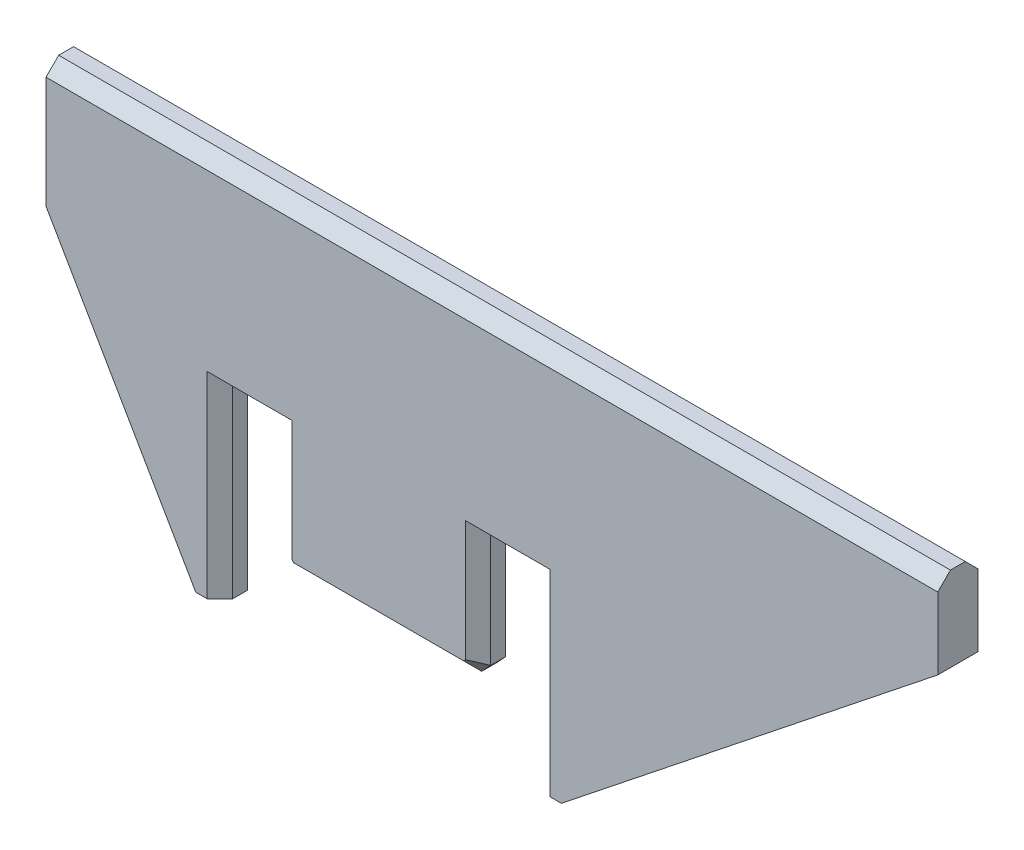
ISO-10303-21;
HEADER;
FILE_DESCRIPTION(('STEP AP214'),'2;1');
FILE_NAME('part.step','',(''),(''),'','','');
FILE_SCHEMA(('AUTOMOTIVE_DESIGN { 1 0 10303 214 1 1 1 1 }'));
ENDSEC;
DATA;
#1=APPLICATION_CONTEXT('core data for automotive mechanical design processes');
#2=APPLICATION_PROTOCOL_DEFINITION('international standard','automotive_design',2000,#1);
#3=PRODUCT_CONTEXT('',#1,'mechanical');
#4=PRODUCT('Part','Part','',(#3));
#5=PRODUCT_RELATED_PRODUCT_CATEGORY('part','',(#4));
#6=PRODUCT_DEFINITION_FORMATION('','',#4);
#7=PRODUCT_DEFINITION_CONTEXT('part definition',#1,'design');
#8=PRODUCT_DEFINITION('design','',#6,#7);
#9=PRODUCT_DEFINITION_SHAPE('','',#8);
#10=(LENGTH_UNIT() NAMED_UNIT(*) SI_UNIT(.MILLI.,.METRE.));
#11=(NAMED_UNIT(*) PLANE_ANGLE_UNIT() SI_UNIT($,.RADIAN.));
#12=(NAMED_UNIT(*) SI_UNIT($,.STERADIAN.) SOLID_ANGLE_UNIT());
#13=UNCERTAINTY_MEASURE_WITH_UNIT(LENGTH_MEASURE(1.E-05),#10,'distance_accuracy_value','');
#14=(GEOMETRIC_REPRESENTATION_CONTEXT(3) GLOBAL_UNCERTAINTY_ASSIGNED_CONTEXT((#13)) GLOBAL_UNIT_ASSIGNED_CONTEXT((#10,
#11,#12)) REPRESENTATION_CONTEXT('',''));
#15=CARTESIAN_POINT('',(0.,0.,0.));
#16=DIRECTION('',(0.,0.,1.));
#17=DIRECTION('',(1.,0.,0.));
#18=AXIS2_PLACEMENT_3D('',#15,#16,#17);
#19=CARTESIAN_POINT('',(882.496500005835,320.,31.75));
#20=DIRECTION('',(-1.,0.,0.));
#21=DIRECTION('',(0.,-1.,0.));
#22=AXIS2_PLACEMENT_3D('',#19,#20,#21);
#23=PLANE('',#22);
#24=DIRECTION('',(0.,1.,0.));
#25=VECTOR('',#24,1.);
#26=CARTESIAN_POINT('',(882.496500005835,320.,-31.75));
#27=LINE('',#26,#25);
#28=CARTESIAN_POINT('',(882.496500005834,186.669332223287,-31.75));
#29=VERTEX_POINT('',#28);
#30=CARTESIAN_POINT('',(882.496500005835,300.,-31.75));
#31=VERTEX_POINT('',#30);
#32=EDGE_CURVE('E279',#29,#31,#27,.T.);
#33=ORIENTED_EDGE('',*,*,#32,.T.);
#34=DIRECTION('',(0.,-0.707106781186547,-0.707106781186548));
#35=VECTOR('',#34,1.);
#36=CARTESIAN_POINT('',(882.496500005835,319.999999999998,-11.7500000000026));
#37=LINE('',#36,#35);
#38=CARTESIAN_POINT('',(882.496500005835,320.,-11.7500000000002));
#39=VERTEX_POINT('',#38);
#40=EDGE_CURVE('E489',#31,#39,#37,.F.);
#41=ORIENTED_EDGE('',*,*,#40,.T.);
#42=DIRECTION('',(0.,0.,-1.));
#43=VECTOR('',#42,1.);
#44=CARTESIAN_POINT('',(882.496500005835,320.,31.75));
#45=LINE('',#44,#43);
#46=CARTESIAN_POINT('',(882.496500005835,320.,11.7500000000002));
#47=VERTEX_POINT('',#46);
#48=EDGE_CURVE('E346',#47,#39,#45,.T.);
#49=ORIENTED_EDGE('',*,*,#48,.F.);
#50=DIRECTION('',(0.,-0.707106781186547,0.707106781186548));
#51=VECTOR('',#50,1.);
#52=CARTESIAN_POINT('',(882.496500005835,299.999999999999,31.7500000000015));
#53=LINE('',#52,#51);
#54=CARTESIAN_POINT('',(882.496500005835,300.,31.75));
#55=VERTEX_POINT('',#54);
#56=EDGE_CURVE('E387',#47,#55,#53,.T.);
#57=ORIENTED_EDGE('',*,*,#56,.T.);
#58=DIRECTION('',(0.,1.,0.));
#59=VECTOR('',#58,1.);
#60=CARTESIAN_POINT('',(882.496500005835,320.,31.75));
#61=LINE('',#60,#59);
#62=CARTESIAN_POINT('',(882.496500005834,186.669332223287,31.75));
#63=VERTEX_POINT('',#62);
#64=EDGE_CURVE('E250',#63,#55,#61,.T.);
#65=ORIENTED_EDGE('',*,*,#64,.F.);
#66=DIRECTION('',(0.,0.,-1.));
#67=VECTOR('',#66,1.);
#68=CARTESIAN_POINT('',(882.496500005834,186.669332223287,31.75));
#69=LINE('',#68,#67);
#70=EDGE_CURVE('E280',#63,#29,#69,.T.);
#71=ORIENTED_EDGE('',*,*,#70,.T.);
#72=EDGE_LOOP('',(#33,#41,#49,#57,#65,#71));
#73=FACE_BOUND('',#72,.T.);
#74=ADVANCED_FACE('F46',(#73),#23,.F.);
#75=CARTESIAN_POINT('',(-524.878159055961,320.,31.75));
#76=DIRECTION('',(0.,-1.,0.));
#77=DIRECTION('',(1.,0.,0.));
#78=AXIS2_PLACEMENT_3D('',#75,#76,#77);
#79=PLANE('',#78);
#80=ORIENTED_EDGE('',*,*,#48,.T.);
#81=DIRECTION('',(-1.,0.,0.));
#82=VECTOR('',#81,1.);
#83=CARTESIAN_POINT('',(-524.878159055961,320.,-11.7500000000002));
#84=LINE('',#83,#82);
#85=CARTESIAN_POINT('',(-524.878159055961,320.,-11.7500000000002));
#86=VERTEX_POINT('',#85);
#87=EDGE_CURVE('E422',#39,#86,#84,.T.);
#88=ORIENTED_EDGE('',*,*,#87,.T.);
#89=DIRECTION('',(0.,0.,-1.));
#90=VECTOR('',#89,1.);
#91=CARTESIAN_POINT('',(-524.878159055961,320.,31.75));
#92=LINE('',#91,#90);
#93=CARTESIAN_POINT('',(-524.878159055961,320.,11.7500000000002));
#94=VERTEX_POINT('',#93);
#95=EDGE_CURVE('E259',#94,#86,#92,.T.);
#96=ORIENTED_EDGE('',*,*,#95,.F.);
#97=DIRECTION('',(1.,0.,0.));
#98=VECTOR('',#97,1.);
#99=CARTESIAN_POINT('',(882.496500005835,320.,11.7500000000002));
#100=LINE('',#99,#98);
#101=EDGE_CURVE('E384',#94,#47,#100,.T.);
#102=ORIENTED_EDGE('',*,*,#101,.T.);
#103=EDGE_LOOP('',(#80,#88,#96,#102));
#104=FACE_BOUND('',#103,.T.);
#105=ADVANCED_FACE('F627',(#104),#79,.F.);
#106=CARTESIAN_POINT('',(-524.878159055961,320.,31.75));
#107=DIRECTION('',(1.,0.,0.));
#108=DIRECTION('',(0.,1.,0.));
#109=AXIS2_PLACEMENT_3D('',#106,#107,#108);
#110=PLANE('',#109);
#111=ORIENTED_EDGE('',*,*,#95,.T.);
#112=DIRECTION('',(0.,0.707106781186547,0.707106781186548));
#113=VECTOR('',#112,1.);
#114=CARTESIAN_POINT('',(-524.878159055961,320.,-11.7500000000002));
#115=LINE('',#114,#113);
#116=CARTESIAN_POINT('',(-524.878159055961,300.,-31.75));
#117=VERTEX_POINT('',#116);
#118=EDGE_CURVE('E460',#86,#117,#115,.F.);
#119=ORIENTED_EDGE('',*,*,#118,.T.);
#120=DIRECTION('',(0.,-1.,0.));
#121=VECTOR('',#120,1.);
#122=CARTESIAN_POINT('',(-524.878159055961,320.,-31.75));
#123=LINE('',#122,#121);
#124=CARTESIAN_POINT('',(-524.878159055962,123.605909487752,-31.75));
#125=VERTEX_POINT('',#124);
#126=EDGE_CURVE('E251',#117,#125,#123,.T.);
#127=ORIENTED_EDGE('',*,*,#126,.T.);
#128=DIRECTION('',(0.,0.,-1.));
#129=VECTOR('',#128,1.);
#130=CARTESIAN_POINT('',(-524.878159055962,123.605909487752,31.75));
#131=LINE('',#130,#129);
#132=CARTESIAN_POINT('',(-524.878159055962,123.605909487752,31.75));
#133=VERTEX_POINT('',#132);
#134=EDGE_CURVE('E249',#133,#125,#131,.T.);
#135=ORIENTED_EDGE('',*,*,#134,.F.);
#136=DIRECTION('',(0.,-1.,0.));
#137=VECTOR('',#136,1.);
#138=CARTESIAN_POINT('',(-524.878159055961,320.,31.75));
#139=LINE('',#138,#137);
#140=CARTESIAN_POINT('',(-524.878159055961,300.,31.75));
#141=VERTEX_POINT('',#140);
#142=EDGE_CURVE('E232',#141,#133,#139,.T.);
#143=ORIENTED_EDGE('',*,*,#142,.F.);
#144=DIRECTION('',(0.,0.707106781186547,-0.707106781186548));
#145=VECTOR('',#144,1.);
#146=CARTESIAN_POINT('',(-524.878159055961,300.000000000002,31.7499999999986));
#147=LINE('',#146,#145);
#148=EDGE_CURVE('E379',#141,#94,#147,.T.);
#149=ORIENTED_EDGE('',*,*,#148,.T.);
#150=EDGE_LOOP('',(#111,#119,#127,#135,#143,#149));
#151=FACE_BOUND('',#150,.T.);
#152=ADVANCED_FACE('F255',(#151),#110,.F.);
#153=CARTESIAN_POINT('',(-288.496,-285.82,31.75));
#154=DIRECTION('',(0.866025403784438,0.500000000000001,0.));
#155=DIRECTION('',(-0.500000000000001,0.866025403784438,0.));
#156=AXIS2_PLACEMENT_3D('',#153,#154,#155);
#157=PLANE('',#156);
#158=DIRECTION('',(0.500000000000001,-0.866025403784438,0.));
#159=VECTOR('',#158,1.);
#160=CARTESIAN_POINT('',(-288.496,-285.82,-31.75));
#161=LINE('',#160,#159);
#162=CARTESIAN_POINT('',(-288.496,-285.82,-31.75));
#163=VERTEX_POINT('',#162);
#164=EDGE_CURVE('E284',#125,#163,#161,.T.);
#165=ORIENTED_EDGE('',*,*,#164,.T.);
#166=DIRECTION('',(0.,0.,-1.));
#167=VECTOR('',#166,1.);
#168=CARTESIAN_POINT('',(-288.496,-285.82,31.75));
#169=LINE('',#168,#167);
#170=CARTESIAN_POINT('',(-288.496,-285.82,31.75));
#171=VERTEX_POINT('',#170);
#172=EDGE_CURVE('E256',#171,#163,#169,.T.);
#173=ORIENTED_EDGE('',*,*,#172,.F.);
#174=DIRECTION('',(0.500000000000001,-0.866025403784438,0.));
#175=VECTOR('',#174,1.);
#176=CARTESIAN_POINT('',(-288.496,-285.82,31.75));
#177=LINE('',#176,#175);
#178=EDGE_CURVE('E241',#133,#171,#177,.T.);
#179=ORIENTED_EDGE('',*,*,#178,.F.);
#180=ORIENTED_EDGE('',*,*,#134,.T.);
#181=EDGE_LOOP('',(#165,#173,#179,#180));
#182=FACE_BOUND('',#181,.T.);
#183=ADVANCED_FACE('F261',(#182),#157,.F.);
#184=CARTESIAN_POINT('',(-250.396,-285.82,31.75));
#185=DIRECTION('',(0.,1.,0.));
#186=DIRECTION('',(0.,0.,1.));
#187=AXIS2_PLACEMENT_3D('',#184,#185,#186);
#188=PLANE('',#187);
#189=DIRECTION('',(1.,0.,0.));
#190=VECTOR('',#189,1.);
#191=CARTESIAN_POINT('',(-250.396,-285.82,-31.75));
#192=LINE('',#191,#190);
#193=CARTESIAN_POINT('',(-270.396,-285.82,-31.75));
#194=VERTEX_POINT('',#193);
#195=EDGE_CURVE('E287',#163,#194,#192,.T.);
#196=ORIENTED_EDGE('',*,*,#195,.T.);
#197=DIRECTION('',(-0.707106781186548,0.,-0.707106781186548));
#198=VECTOR('',#197,1.);
#199=CARTESIAN_POINT('',(-250.396,-285.82,-11.75));
#200=LINE('',#199,#198);
#201=CARTESIAN_POINT('',(-250.396,-285.82,-11.75));
#202=VERTEX_POINT('',#201);
#203=EDGE_CURVE('E11',#194,#202,#200,.F.);
#204=ORIENTED_EDGE('',*,*,#203,.T.);
#205=DIRECTION('',(0.,0.,-1.));
#206=VECTOR('',#205,1.);
#207=CARTESIAN_POINT('',(-250.396,-285.82,31.75));
#208=LINE('',#207,#206);
#209=CARTESIAN_POINT('',(-250.396,-285.82,11.7499999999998));
#210=VERTEX_POINT('',#209);
#211=EDGE_CURVE('E339',#210,#202,#208,.T.);
#212=ORIENTED_EDGE('',*,*,#211,.F.);
#213=DIRECTION('',(-0.707106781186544,0.,0.707106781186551));
#214=VECTOR('',#213,1.);
#215=CARTESIAN_POINT('',(-270.396,-285.82,31.75));
#216=LINE('',#215,#214);
#217=CARTESIAN_POINT('',(-270.396,-285.82,31.75));
#218=VERTEX_POINT('',#217);
#219=EDGE_CURVE('E420',#210,#218,#216,.T.);
#220=ORIENTED_EDGE('',*,*,#219,.T.);
#221=DIRECTION('',(1.,0.,0.));
#222=VECTOR('',#221,1.);
#223=CARTESIAN_POINT('',(-250.396,-285.82,31.75));
#224=LINE('',#223,#222);
#225=EDGE_CURVE('E264',#171,#218,#224,.T.);
#226=ORIENTED_EDGE('',*,*,#225,.F.);
#227=ORIENTED_EDGE('',*,*,#172,.T.);
#228=EDGE_LOOP('',(#196,#204,#212,#220,#226,#227));
#229=FACE_BOUND('',#228,.T.);
#230=ADVANCED_FACE('F564',(#229),#188,.F.);
#231=CARTESIAN_POINT('',(-250.396,-285.82,31.75));
#232=DIRECTION('',(-1.,0.,0.));
#233=DIRECTION('',(0.,0.,1.));
#234=AXIS2_PLACEMENT_3D('',#231,#232,#233);
#235=PLANE('',#234);
#236=ORIENTED_EDGE('',*,*,#211,.T.);
#237=DIRECTION('',(0.,1.,0.));
#238=VECTOR('',#237,1.);
#239=CARTESIAN_POINT('',(-250.396,-285.82,-11.75));
#240=LINE('',#239,#238);
#241=CARTESIAN_POINT('',(-250.396,5.,-11.75));
#242=VERTEX_POINT('',#241);
#243=EDGE_CURVE('E60',#202,#242,#240,.T.);
#244=ORIENTED_EDGE('',*,*,#243,.T.);
#245=DIRECTION('',(0.,0.,-1.));
#246=VECTOR('',#245,1.);
#247=CARTESIAN_POINT('',(-250.396,5.,31.75));
#248=LINE('',#247,#246);
#249=CARTESIAN_POINT('',(-250.396,5.,11.7499999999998));
#250=VERTEX_POINT('',#249);
#251=EDGE_CURVE('E337',#250,#242,#248,.T.);
#252=ORIENTED_EDGE('',*,*,#251,.F.);
#253=DIRECTION('',(0.,-1.,0.));
#254=VECTOR('',#253,1.);
#255=CARTESIAN_POINT('',(-250.396,-285.82,11.7499999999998));
#256=LINE('',#255,#254);
#257=EDGE_CURVE('E418',#250,#210,#256,.T.);
#258=ORIENTED_EDGE('',*,*,#257,.T.);
#259=EDGE_LOOP('',(#236,#244,#252,#258));
#260=FACE_BOUND('',#259,.T.);
#261=ADVANCED_FACE('F853',(#260),#235,.F.);
#262=CARTESIAN_POINT('',(-250.396,5.,31.75));
#263=DIRECTION('',(0.,1.,0.));
#264=DIRECTION('',(0.,0.,1.));
#265=AXIS2_PLACEMENT_3D('',#262,#263,#264);
#266=PLANE('',#265);
#267=ORIENTED_EDGE('',*,*,#251,.T.);
#268=DIRECTION('',(1.,0.,0.));
#269=VECTOR('',#268,1.);
#270=CARTESIAN_POINT('',(-250.396,5.,-11.75));
#271=LINE('',#270,#269);
#272=CARTESIAN_POINT('',(-157.02,5.,-11.75));
#273=VERTEX_POINT('',#272);
#274=EDGE_CURVE('E519',#242,#273,#271,.T.);
#275=ORIENTED_EDGE('',*,*,#274,.T.);
#276=DIRECTION('',(0.,0.,-1.));
#277=VECTOR('',#276,1.);
#278=CARTESIAN_POINT('',(-157.02,5.,31.75));
#279=LINE('',#278,#277);
#280=CARTESIAN_POINT('',(-157.02,5.,11.7499999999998));
#281=VERTEX_POINT('',#280);
#282=EDGE_CURVE('E334',#281,#273,#279,.T.);
#283=ORIENTED_EDGE('',*,*,#282,.F.);
#284=DIRECTION('',(-1.,0.,0.));
#285=VECTOR('',#284,1.);
#286=CARTESIAN_POINT('',(-250.396,5.,11.7499999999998));
#287=LINE('',#286,#285);
#288=EDGE_CURVE('E412',#281,#250,#287,.T.);
#289=ORIENTED_EDGE('',*,*,#288,.T.);
#290=EDGE_LOOP('',(#267,#275,#283,#289));
#291=FACE_BOUND('',#290,.T.);
#292=ADVANCED_FACE('F845',(#291),#266,.F.);
#293=CARTESIAN_POINT('',(-157.02,-172.974,31.75));
#294=DIRECTION('',(1.,0.,0.));
#295=DIRECTION('',(0.,0.,-1.));
#296=AXIS2_PLACEMENT_3D('',#293,#294,#295);
#297=PLANE('',#296);
#298=ORIENTED_EDGE('',*,*,#282,.T.);
#299=DIRECTION('',(0.,-1.,0.));
#300=VECTOR('',#299,1.);
#301=CARTESIAN_POINT('',(-157.02,-172.974,-11.75));
#302=LINE('',#301,#300);
#303=CARTESIAN_POINT('',(-157.02,-172.974,-11.75));
#304=VERTEX_POINT('',#303);
#305=EDGE_CURVE('E513',#273,#304,#302,.T.);
#306=ORIENTED_EDGE('',*,*,#305,.T.);
#307=DIRECTION('',(0.,0.,-1.));
#308=VECTOR('',#307,1.);
#309=CARTESIAN_POINT('',(-157.02,-172.974,31.75));
#310=LINE('',#309,#308);
#311=CARTESIAN_POINT('',(-157.02,-172.974,11.7499999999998));
#312=VERTEX_POINT('',#311);
#313=EDGE_CURVE('E327',#312,#304,#310,.T.);
#314=ORIENTED_EDGE('',*,*,#313,.F.);
#315=DIRECTION('',(0.,1.,0.));
#316=VECTOR('',#315,1.);
#317=CARTESIAN_POINT('',(-157.02,5.,11.7499999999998));
#318=LINE('',#317,#316);
#319=EDGE_CURVE('E408',#312,#281,#318,.T.);
#320=ORIENTED_EDGE('',*,*,#319,.T.);
#321=EDGE_LOOP('',(#298,#306,#314,#320));
#322=FACE_BOUND('',#321,.T.);
#323=ADVANCED_FACE('F832',(#322),#297,.F.);
#324=CARTESIAN_POINT('',(-142.78,-188.214,31.75));
#325=DIRECTION('',(0.730672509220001,0.682728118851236,0.));
#326=DIRECTION('',(-0.682728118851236,0.730672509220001,0.));
#327=AXIS2_PLACEMENT_3D('',#324,#325,#326);
#328=PLANE('',#327);
#329=ORIENTED_EDGE('',*,*,#313,.T.);
#330=DIRECTION('',(0.682728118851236,-0.730672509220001,0.));
#331=VECTOR('',#330,1.);
#332=CARTESIAN_POINT('',(-142.78,-188.214,-11.75));
#333=LINE('',#332,#331);
#334=CARTESIAN_POINT('',(-142.78,-188.214,-11.75));
#335=VERTEX_POINT('',#334);
#336=EDGE_CURVE('E515',#304,#335,#333,.T.);
#337=ORIENTED_EDGE('',*,*,#336,.T.);
#338=DIRECTION('',(0.,0.,-1.));
#339=VECTOR('',#338,1.);
#340=CARTESIAN_POINT('',(-142.78,-188.214,31.75));
#341=LINE('',#340,#339);
#342=CARTESIAN_POINT('',(-142.78,-188.214,11.7499999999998));
#343=VERTEX_POINT('',#342);
#344=EDGE_CURVE('E321',#343,#335,#341,.T.);
#345=ORIENTED_EDGE('',*,*,#344,.F.);
#346=DIRECTION('',(-0.682728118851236,0.730672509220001,0.));
#347=VECTOR('',#346,1.);
#348=CARTESIAN_POINT('',(-157.02,-172.974,11.7499999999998));
#349=LINE('',#348,#347);
#350=EDGE_CURVE('E410',#343,#312,#349,.T.);
#351=ORIENTED_EDGE('',*,*,#350,.T.);
#352=EDGE_LOOP('',(#329,#337,#345,#351));
#353=FACE_BOUND('',#352,.T.);
#354=ADVANCED_FACE('F822',(#353),#328,.F.);
#355=CARTESIAN_POINT('',(142.78,-188.214,31.75));
#356=DIRECTION('',(0.,1.,0.));
#357=DIRECTION('',(0.,0.,1.));
#358=AXIS2_PLACEMENT_3D('',#355,#356,#357);
#359=PLANE('',#358);
#360=ORIENTED_EDGE('',*,*,#344,.T.);
#361=DIRECTION('',(1.,0.,0.));
#362=VECTOR('',#361,1.);
#363=CARTESIAN_POINT('',(142.78,-188.214,-11.75));
#364=LINE('',#363,#362);
#365=CARTESIAN_POINT('',(142.78,-188.214,-11.75));
#366=VERTEX_POINT('',#365);
#367=EDGE_CURVE('E508',#335,#366,#364,.T.);
#368=ORIENTED_EDGE('',*,*,#367,.T.);
#369=DIRECTION('',(0.,0.,-1.));
#370=VECTOR('',#369,1.);
#371=CARTESIAN_POINT('',(142.78,-188.214,31.75));
#372=LINE('',#371,#370);
#373=CARTESIAN_POINT('',(142.78,-188.214,11.7499999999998));
#374=VERTEX_POINT('',#373);
#375=EDGE_CURVE('E318',#374,#366,#372,.T.);
#376=ORIENTED_EDGE('',*,*,#375,.F.);
#377=DIRECTION('',(-1.,0.,0.));
#378=VECTOR('',#377,1.);
#379=CARTESIAN_POINT('',(-142.78,-188.214,11.7499999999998));
#380=LINE('',#379,#378);
#381=EDGE_CURVE('E404',#374,#343,#380,.T.);
#382=ORIENTED_EDGE('',*,*,#381,.T.);
#383=EDGE_LOOP('',(#360,#368,#376,#382));
#384=FACE_BOUND('',#383,.T.);
#385=ADVANCED_FACE('F814',(#384),#359,.F.);
#386=CARTESIAN_POINT('',(142.78,-188.214,31.75));
#387=DIRECTION('',(-0.730672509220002,0.682728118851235,0.));
#388=DIRECTION('',(-0.682728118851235,-0.730672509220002,0.));
#389=AXIS2_PLACEMENT_3D('',#386,#387,#388);
#390=PLANE('',#389);
#391=ORIENTED_EDGE('',*,*,#375,.T.);
#392=DIRECTION('',(0.682728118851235,0.730672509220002,0.));
#393=VECTOR('',#392,1.);
#394=CARTESIAN_POINT('',(142.78,-188.214,-11.75));
#395=LINE('',#394,#393);
#396=CARTESIAN_POINT('',(157.02,-172.974,-11.75));
#397=VERTEX_POINT('',#396);
#398=EDGE_CURVE('E506',#366,#397,#395,.T.);
#399=ORIENTED_EDGE('',*,*,#398,.T.);
#400=DIRECTION('',(0.,0.,-1.));
#401=VECTOR('',#400,1.);
#402=CARTESIAN_POINT('',(157.02,-172.974,31.75));
#403=LINE('',#402,#401);
#404=CARTESIAN_POINT('',(157.02,-172.974,11.7499999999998));
#405=VERTEX_POINT('',#404);
#406=EDGE_CURVE('E317',#405,#397,#403,.T.);
#407=ORIENTED_EDGE('',*,*,#406,.F.);
#408=DIRECTION('',(-0.682728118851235,-0.730672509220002,0.));
#409=VECTOR('',#408,1.);
#410=CARTESIAN_POINT('',(142.78,-188.214,11.7499999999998));
#411=LINE('',#410,#409);
#412=EDGE_CURVE('E402',#405,#374,#411,.T.);
#413=ORIENTED_EDGE('',*,*,#412,.T.);
#414=EDGE_LOOP('',(#391,#399,#407,#413));
#415=FACE_BOUND('',#414,.T.);
#416=ADVANCED_FACE('F808',(#415),#390,.F.);
#417=CARTESIAN_POINT('',(157.02,5.00000000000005,31.75));
#418=DIRECTION('',(-1.,0.,0.));
#419=DIRECTION('',(0.,-1.,0.));
#420=AXIS2_PLACEMENT_3D('',#417,#418,#419);
#421=PLANE('',#420);
#422=ORIENTED_EDGE('',*,*,#406,.T.);
#423=DIRECTION('',(0.,1.,0.));
#424=VECTOR('',#423,1.);
#425=CARTESIAN_POINT('',(157.02,5.00000000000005,-11.75));
#426=LINE('',#425,#424);
#427=CARTESIAN_POINT('',(157.02,5.00000000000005,-11.75));
#428=VERTEX_POINT('',#427);
#429=EDGE_CURVE('E503',#397,#428,#426,.T.);
#430=ORIENTED_EDGE('',*,*,#429,.T.);
#431=DIRECTION('',(0.,0.,-1.));
#432=VECTOR('',#431,1.);
#433=CARTESIAN_POINT('',(157.02,5.00000000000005,31.75));
#434=LINE('',#433,#432);
#435=CARTESIAN_POINT('',(157.02,5.00000000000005,11.7499999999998));
#436=VERTEX_POINT('',#435);
#437=EDGE_CURVE('E315',#436,#428,#434,.T.);
#438=ORIENTED_EDGE('',*,*,#437,.F.);
#439=DIRECTION('',(0.,-1.,0.));
#440=VECTOR('',#439,1.);
#441=CARTESIAN_POINT('',(157.02,-172.974,11.7499999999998));
#442=LINE('',#441,#440);
#443=EDGE_CURVE('E397',#436,#405,#442,.T.);
#444=ORIENTED_EDGE('',*,*,#443,.T.);
#445=EDGE_LOOP('',(#422,#430,#438,#444));
#446=FACE_BOUND('',#445,.T.);
#447=ADVANCED_FACE('F800',(#446),#421,.F.);
#448=CARTESIAN_POINT('',(157.02,5.00000000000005,31.75));
#449=DIRECTION('',(0.,1.,0.));
#450=DIRECTION('',(-1.,0.,0.));
#451=AXIS2_PLACEMENT_3D('',#448,#449,#450);
#452=PLANE('',#451);
#453=ORIENTED_EDGE('',*,*,#437,.T.);
#454=DIRECTION('',(1.,0.,0.));
#455=VECTOR('',#454,1.);
#456=CARTESIAN_POINT('',(157.02,5.00000000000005,-11.75));
#457=LINE('',#456,#455);
#458=CARTESIAN_POINT('',(250.396,5.00000000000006,-11.75));
#459=VERTEX_POINT('',#458);
#460=EDGE_CURVE('E499',#428,#459,#457,.T.);
#461=ORIENTED_EDGE('',*,*,#460,.T.);
#462=DIRECTION('',(0.,0.,-1.));
#463=VECTOR('',#462,1.);
#464=CARTESIAN_POINT('',(250.396,5.00000000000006,31.75));
#465=LINE('',#464,#463);
#466=CARTESIAN_POINT('',(250.396,5.00000000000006,11.7499999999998));
#467=VERTEX_POINT('',#466);
#468=EDGE_CURVE('E308',#467,#459,#465,.T.);
#469=ORIENTED_EDGE('',*,*,#468,.F.);
#470=DIRECTION('',(-1.,0.,0.));
#471=VECTOR('',#470,1.);
#472=CARTESIAN_POINT('',(157.02,5.00000000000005,11.7499999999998));
#473=LINE('',#472,#471);
#474=EDGE_CURVE('E394',#467,#436,#473,.T.);
#475=ORIENTED_EDGE('',*,*,#474,.T.);
#476=EDGE_LOOP('',(#453,#461,#469,#475));
#477=FACE_BOUND('',#476,.T.);
#478=ADVANCED_FACE('F787',(#477),#452,.F.);
#479=CARTESIAN_POINT('',(250.396,-285.82,31.75));
#480=DIRECTION('',(1.,0.,0.));
#481=DIRECTION('',(0.,0.,-1.));
#482=AXIS2_PLACEMENT_3D('',#479,#480,#481);
#483=PLANE('',#482);
#484=ORIENTED_EDGE('',*,*,#468,.T.);
#485=DIRECTION('',(0.,-1.,0.));
#486=VECTOR('',#485,1.);
#487=CARTESIAN_POINT('',(250.396,-285.82,-11.75));
#488=LINE('',#487,#486);
#489=CARTESIAN_POINT('',(250.396,-285.82,-11.75));
#490=VERTEX_POINT('',#489);
#491=EDGE_CURVE('E491',#459,#490,#488,.T.);
#492=ORIENTED_EDGE('',*,*,#491,.T.);
#493=DIRECTION('',(0.,0.,-1.));
#494=VECTOR('',#493,1.);
#495=CARTESIAN_POINT('',(250.396,-285.82,31.75));
#496=LINE('',#495,#494);
#497=CARTESIAN_POINT('',(250.396,-285.82,11.7499999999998));
#498=VERTEX_POINT('',#497);
#499=EDGE_CURVE('E302',#498,#490,#496,.T.);
#500=ORIENTED_EDGE('',*,*,#499,.F.);
#501=DIRECTION('',(0.,1.,0.));
#502=VECTOR('',#501,1.);
#503=CARTESIAN_POINT('',(250.396,5.00000000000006,11.7499999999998));
#504=LINE('',#503,#502);
#505=EDGE_CURVE('E395',#498,#467,#504,.T.);
#506=ORIENTED_EDGE('',*,*,#505,.T.);
#507=EDGE_LOOP('',(#484,#492,#500,#506));
#508=FACE_BOUND('',#507,.T.);
#509=ADVANCED_FACE('F776',(#508),#483,.F.);
#510=CARTESIAN_POINT('',(250.396,-285.82,31.75));
#511=DIRECTION('',(0.,1.,0.));
#512=DIRECTION('',(-1.,0.,0.));
#513=AXIS2_PLACEMENT_3D('',#510,#511,#512);
#514=PLANE('',#513);
#515=ORIENTED_EDGE('',*,*,#499,.T.);
#516=DIRECTION('',(-0.707106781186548,0.,0.707106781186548));
#517=VECTOR('',#516,1.);
#518=CARTESIAN_POINT('',(250.396,-285.82,-11.75));
#519=LINE('',#518,#517);
#520=CARTESIAN_POINT('',(270.396,-285.82,-31.75));
#521=VERTEX_POINT('',#520);
#522=EDGE_CURVE('E500',#490,#521,#519,.F.);
#523=ORIENTED_EDGE('',*,*,#522,.T.);
#524=DIRECTION('',(1.,0.,0.));
#525=VECTOR('',#524,1.);
#526=CARTESIAN_POINT('',(250.396,-285.82,-31.75));
#527=LINE('',#526,#525);
#528=CARTESIAN_POINT('',(288.496,-285.82,-31.75));
#529=VERTEX_POINT('',#528);
#530=EDGE_CURVE('E293',#521,#529,#527,.T.);
#531=ORIENTED_EDGE('',*,*,#530,.T.);
#532=DIRECTION('',(0.,0.,-1.));
#533=VECTOR('',#532,1.);
#534=CARTESIAN_POINT('',(288.496,-285.82,31.75));
#535=LINE('',#534,#533);
#536=CARTESIAN_POINT('',(288.496,-285.82,31.75));
#537=VERTEX_POINT('',#536);
#538=EDGE_CURVE('E297',#537,#529,#535,.T.);
#539=ORIENTED_EDGE('',*,*,#538,.F.);
#540=DIRECTION('',(1.,0.,0.));
#541=VECTOR('',#540,1.);
#542=CARTESIAN_POINT('',(250.396,-285.82,31.75));
#543=LINE('',#542,#541);
#544=CARTESIAN_POINT('',(270.396,-285.82,31.75));
#545=VERTEX_POINT('',#544);
#546=EDGE_CURVE('E267',#545,#537,#543,.T.);
#547=ORIENTED_EDGE('',*,*,#546,.F.);
#548=DIRECTION('',(-0.707106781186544,0.,-0.707106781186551));
#549=VECTOR('',#548,1.);
#550=CARTESIAN_POINT('',(270.396,-285.82,31.7500000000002));
#551=LINE('',#550,#549);
#552=EDGE_CURVE('E386',#545,#498,#551,.T.);
#553=ORIENTED_EDGE('',*,*,#552,.T.);
#554=EDGE_LOOP('',(#515,#523,#531,#539,#547,#553));
#555=FACE_BOUND('',#554,.T.);
#556=ADVANCED_FACE('F614',(#555),#514,.F.);
#557=CARTESIAN_POINT('',(288.496,-285.82,31.75));
#558=DIRECTION('',(-0.622514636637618,0.782608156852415,0.));
#559=DIRECTION('',(-0.782608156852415,-0.622514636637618,0.));
#560=AXIS2_PLACEMENT_3D('',#557,#558,#559);
#561=PLANE('',#560);
#562=DIRECTION('',(0.782608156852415,0.622514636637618,0.));
#563=VECTOR('',#562,1.);
#564=CARTESIAN_POINT('',(288.496,-285.82,-31.75));
#565=LINE('',#564,#563);
#566=EDGE_CURVE('E295',#529,#29,#565,.T.);
#567=ORIENTED_EDGE('',*,*,#566,.T.);
#568=ORIENTED_EDGE('',*,*,#70,.F.);
#569=DIRECTION('',(0.782608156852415,0.622514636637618,0.));
#570=VECTOR('',#569,1.);
#571=CARTESIAN_POINT('',(288.496,-285.82,31.75));
#572=LINE('',#571,#570);
#573=EDGE_CURVE('E274',#537,#63,#572,.T.);
#574=ORIENTED_EDGE('',*,*,#573,.F.);
#575=ORIENTED_EDGE('',*,*,#538,.T.);
#576=EDGE_LOOP('',(#567,#568,#574,#575));
#577=FACE_BOUND('',#576,.T.);
#578=ADVANCED_FACE('F620',(#577),#561,.F.);
#579=CARTESIAN_POINT('',(0.,0.,31.75));
#580=DIRECTION('',(0.,0.,1.));
#581=DIRECTION('',(1.,0.,0.));
#582=AXIS2_PLACEMENT_3D('',#579,#580,#581);
#583=PLANE('',#582);
#584=ORIENTED_EDGE('',*,*,#64,.T.);
#585=DIRECTION('',(-1.,0.,0.));
#586=VECTOR('',#585,1.);
#587=CARTESIAN_POINT('',(-524.878159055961,300.,31.75));
#588=LINE('',#587,#586);
#589=EDGE_CURVE('E242',#55,#141,#588,.T.);
#590=ORIENTED_EDGE('',*,*,#589,.T.);
#591=ORIENTED_EDGE('',*,*,#142,.T.);
#592=ORIENTED_EDGE('',*,*,#178,.T.);
#593=ORIENTED_EDGE('',*,*,#225,.T.);
#594=DIRECTION('',(0.,1.,0.));
#595=VECTOR('',#594,1.);
#596=CARTESIAN_POINT('',(-270.396,5.,31.75));
#597=LINE('',#596,#595);
#598=CARTESIAN_POINT('',(-270.396,25.,31.75));
#599=VERTEX_POINT('',#598);
#600=EDGE_CURVE('E349',#218,#599,#597,.T.);
#601=ORIENTED_EDGE('',*,*,#600,.T.);
#602=DIRECTION('',(1.,0.,0.));
#603=VECTOR('',#602,1.);
#604=CARTESIAN_POINT('',(-157.02,25.,31.75));
#605=LINE('',#604,#603);
#606=CARTESIAN_POINT('',(-137.02,25.,31.75));
#607=VERTEX_POINT('',#606);
#608=EDGE_CURVE('E352',#599,#607,#605,.T.);
#609=ORIENTED_EDGE('',*,*,#608,.T.);
#610=DIRECTION('',(0.,-1.,0.));
#611=VECTOR('',#610,1.);
#612=CARTESIAN_POINT('',(-137.02,-172.974,31.75));
#613=LINE('',#612,#611);
#614=CARTESIAN_POINT('',(-137.02,-165.0842563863,31.75));
#615=VERTEX_POINT('',#614);
#616=EDGE_CURVE('E358',#607,#615,#613,.T.);
#617=ORIENTED_EDGE('',*,*,#616,.T.);
#618=DIRECTION('',(0.682728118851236,-0.730672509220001,0.));
#619=VECTOR('',#618,1.);
#620=CARTESIAN_POINT('',(-128.1665498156,-174.559437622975,31.75));
#621=LINE('',#620,#619);
#622=CARTESIAN_POINT('',(-134.09562014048,-168.214,31.75));
#623=VERTEX_POINT('',#622);
#624=EDGE_CURVE('E360',#615,#623,#621,.T.);
#625=ORIENTED_EDGE('',*,*,#624,.T.);
#626=DIRECTION('',(1.,0.,0.));
#627=VECTOR('',#626,1.);
#628=CARTESIAN_POINT('',(142.78,-168.214,31.75));
#629=LINE('',#628,#627);
#630=CARTESIAN_POINT('',(134.09562014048,-168.214,31.75));
#631=VERTEX_POINT('',#630);
#632=EDGE_CURVE('E365',#623,#631,#629,.T.);
#633=ORIENTED_EDGE('',*,*,#632,.T.);
#634=DIRECTION('',(0.682728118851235,0.730672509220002,0.));
#635=VECTOR('',#634,1.);
#636=CARTESIAN_POINT('',(142.4065498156,-159.319437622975,31.75));
#637=LINE('',#636,#635);
#638=CARTESIAN_POINT('',(137.02,-165.0842563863,31.75));
#639=VERTEX_POINT('',#638);
#640=EDGE_CURVE('E362',#631,#639,#637,.T.);
#641=ORIENTED_EDGE('',*,*,#640,.T.);
#642=DIRECTION('',(0.,1.,0.));
#643=VECTOR('',#642,1.);
#644=CARTESIAN_POINT('',(137.02,5.00000000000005,31.75));
#645=LINE('',#644,#643);
#646=CARTESIAN_POINT('',(137.02,25.0000000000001,31.75));
#647=VERTEX_POINT('',#646);
#648=EDGE_CURVE('E368',#639,#647,#645,.T.);
#649=ORIENTED_EDGE('',*,*,#648,.T.);
#650=DIRECTION('',(1.,0.,0.));
#651=VECTOR('',#650,1.);
#652=CARTESIAN_POINT('',(250.396,25.0000000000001,31.75));
#653=LINE('',#652,#651);
#654=CARTESIAN_POINT('',(270.396,25.0000000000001,31.75));
#655=VERTEX_POINT('',#654);
#656=EDGE_CURVE('E371',#647,#655,#653,.T.);
#657=ORIENTED_EDGE('',*,*,#656,.T.);
#658=DIRECTION('',(0.,-1.,0.));
#659=VECTOR('',#658,1.);
#660=CARTESIAN_POINT('',(270.396,-285.82,31.75));
#661=LINE('',#660,#659);
#662=EDGE_CURVE('E372',#655,#545,#661,.T.);
#663=ORIENTED_EDGE('',*,*,#662,.T.);
#664=ORIENTED_EDGE('',*,*,#546,.T.);
#665=ORIENTED_EDGE('',*,*,#573,.T.);
#666=EDGE_LOOP('',(#584,#590,#591,#592,#593,#601,#609,#617,#625,#633,#641,#649,#657,#663,#664,#665));
#667=FACE_BOUND('',#666,.T.);
#668=ADVANCED_FACE('F238',(#667),#583,.T.);
#669=CARTESIAN_POINT('',(0.,0.,-31.75));
#670=DIRECTION('',(0.,0.,1.));
#671=DIRECTION('',(1.,0.,0.));
#672=AXIS2_PLACEMENT_3D('',#669,#670,#671);
#673=PLANE('',#672);
#674=ORIENTED_EDGE('',*,*,#126,.F.);
#675=DIRECTION('',(1.,0.,0.));
#676=VECTOR('',#675,1.);
#677=CARTESIAN_POINT('',(0.,300.,-31.75));
#678=LINE('',#677,#676);
#679=EDGE_CURVE('E487',#117,#31,#678,.T.);
#680=ORIENTED_EDGE('',*,*,#679,.T.);
#681=ORIENTED_EDGE('',*,*,#32,.F.);
#682=ORIENTED_EDGE('',*,*,#566,.F.);
#683=ORIENTED_EDGE('',*,*,#530,.F.);
#684=DIRECTION('',(0.,1.,0.));
#685=VECTOR('',#684,1.);
#686=CARTESIAN_POINT('',(270.396,0.,-31.75));
#687=LINE('',#686,#685);
#688=CARTESIAN_POINT('',(270.396,25.0000000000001,-31.75));
#689=VERTEX_POINT('',#688);
#690=EDGE_CURVE('E485',#521,#689,#687,.T.);
#691=ORIENTED_EDGE('',*,*,#690,.T.);
#692=DIRECTION('',(-1.,0.,0.));
#693=VECTOR('',#692,1.);
#694=CARTESIAN_POINT('',(0.,25.0000000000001,-31.75));
#695=LINE('',#694,#693);
#696=CARTESIAN_POINT('',(137.02,25.0000000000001,-31.75));
#697=VERTEX_POINT('',#696);
#698=EDGE_CURVE('E483',#689,#697,#695,.T.);
#699=ORIENTED_EDGE('',*,*,#698,.T.);
#700=DIRECTION('',(0.,-1.,0.));
#701=VECTOR('',#700,1.);
#702=CARTESIAN_POINT('',(137.02,0.,-31.75));
#703=LINE('',#702,#701);
#704=CARTESIAN_POINT('',(137.02,-165.0842563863,-31.75));
#705=VERTEX_POINT('',#704);
#706=EDGE_CURVE('E477',#697,#705,#703,.T.);
#707=ORIENTED_EDGE('',*,*,#706,.T.);
#708=DIRECTION('',(-0.682728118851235,-0.730672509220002,0.));
#709=VECTOR('',#708,1.);
#710=CARTESIAN_POINT('',(155.504946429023,-145.301209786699,-31.75));
#711=LINE('',#710,#709);
#712=CARTESIAN_POINT('',(134.09562014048,-168.214,-31.75));
#713=VERTEX_POINT('',#712);
#714=EDGE_CURVE('E473',#705,#713,#711,.T.);
#715=ORIENTED_EDGE('',*,*,#714,.T.);
#716=DIRECTION('',(-1.,0.,0.));
#717=VECTOR('',#716,1.);
#718=CARTESIAN_POINT('',(0.,-168.214,-31.75));
#719=LINE('',#718,#717);
#720=CARTESIAN_POINT('',(-134.09562014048,-168.214,-31.75));
#721=VERTEX_POINT('',#720);
#722=EDGE_CURVE('E475',#713,#721,#719,.T.);
#723=ORIENTED_EDGE('',*,*,#722,.T.);
#724=DIRECTION('',(-0.682728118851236,0.730672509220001,0.));
#725=VECTOR('',#724,1.);
#726=CARTESIAN_POINT('',(-155.504946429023,-145.301209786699,-31.75));
#727=LINE('',#726,#725);
#728=CARTESIAN_POINT('',(-137.02,-165.0842563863,-31.75));
#729=VERTEX_POINT('',#728);
#730=EDGE_CURVE('E469',#721,#729,#727,.T.);
#731=ORIENTED_EDGE('',*,*,#730,.T.);
#732=DIRECTION('',(0.,1.,0.));
#733=VECTOR('',#732,1.);
#734=CARTESIAN_POINT('',(-137.02,0.,-31.75));
#735=LINE('',#734,#733);
#736=CARTESIAN_POINT('',(-137.02,25.,-31.75));
#737=VERTEX_POINT('',#736);
#738=EDGE_CURVE('E467',#729,#737,#735,.T.);
#739=ORIENTED_EDGE('',*,*,#738,.T.);
#740=DIRECTION('',(-1.,0.,0.));
#741=VECTOR('',#740,1.);
#742=CARTESIAN_POINT('',(0.,25.,-31.75));
#743=LINE('',#742,#741);
#744=CARTESIAN_POINT('',(-270.396,25.,-31.75));
#745=VERTEX_POINT('',#744);
#746=EDGE_CURVE('E462',#737,#745,#743,.T.);
#747=ORIENTED_EDGE('',*,*,#746,.T.);
#748=DIRECTION('',(0.,-1.,0.));
#749=VECTOR('',#748,1.);
#750=CARTESIAN_POINT('',(-270.396,0.,-31.75));
#751=LINE('',#750,#749);
#752=EDGE_CURVE('E459',#745,#194,#751,.T.);
#753=ORIENTED_EDGE('',*,*,#752,.T.);
#754=ORIENTED_EDGE('',*,*,#195,.F.);
#755=ORIENTED_EDGE('',*,*,#164,.F.);
#756=EDGE_LOOP('',(#674,#680,#681,#682,#683,#691,#699,#707,#715,#723,#731,#739,#747,#753,#754,#755));
#757=FACE_BOUND('',#756,.T.);
#758=ADVANCED_FACE('F562',(#757),#673,.F.);
#759=CARTESIAN_POINT('',(0.,300.,31.75));
#760=DIRECTION('',(0.,0.707106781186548,0.707106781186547));
#761=DIRECTION('',(1.,0.,0.));
#762=AXIS2_PLACEMENT_3D('',#759,#760,#761);
#763=PLANE('',#762);
#764=ORIENTED_EDGE('',*,*,#56,.F.);
#765=ORIENTED_EDGE('',*,*,#101,.F.);
#766=ORIENTED_EDGE('',*,*,#148,.F.);
#767=ORIENTED_EDGE('',*,*,#589,.F.);
#768=EDGE_LOOP('',(#764,#765,#766,#767));
#769=FACE_BOUND('',#768,.T.);
#770=ADVANCED_FACE('F622',(#769),#763,.T.);
#771=CARTESIAN_POINT('',(-270.396,0.,31.75));
#772=DIRECTION('',(0.707106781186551,0.,0.707106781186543));
#773=DIRECTION('',(0.,-1.,0.));
#774=AXIS2_PLACEMENT_3D('',#771,#772,#773);
#775=PLANE('',#774);
#776=ORIENTED_EDGE('',*,*,#219,.F.);
#777=ORIENTED_EDGE('',*,*,#257,.F.);
#778=DIRECTION('',(-0.577350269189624,0.577350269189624,0.57735026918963));
#779=VECTOR('',#778,1.);
#780=CARTESIAN_POINT('',(-180.264000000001,-65.1319999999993,-58.3820000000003));
#781=LINE('',#780,#779);
#782=EDGE_CURVE('E285',#599,#250,#781,.F.);
#783=ORIENTED_EDGE('',*,*,#782,.F.);
#784=ORIENTED_EDGE('',*,*,#600,.F.);
#785=EDGE_LOOP('',(#776,#777,#783,#784));
#786=FACE_BOUND('',#785,.T.);
#787=ADVANCED_FACE('F569',(#786),#775,.T.);
#788=CARTESIAN_POINT('',(0.,25.,31.75));
#789=DIRECTION('',(0.,-0.707106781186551,0.707106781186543));
#790=DIRECTION('',(-1.,0.,0.));
#791=AXIS2_PLACEMENT_3D('',#788,#789,#790);
#792=PLANE('',#791);
#793=ORIENTED_EDGE('',*,*,#782,.T.);
#794=ORIENTED_EDGE('',*,*,#288,.F.);
#795=DIRECTION('',(0.577350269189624,0.577350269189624,0.57735026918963));
#796=VECTOR('',#795,1.);
#797=CARTESIAN_POINT('',(-145.353333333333,16.6666666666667,23.4166666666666));
#798=LINE('',#797,#796);
#799=EDGE_CURVE('E450',#607,#281,#798,.F.);
#800=ORIENTED_EDGE('',*,*,#799,.F.);
#801=ORIENTED_EDGE('',*,*,#608,.F.);
#802=EDGE_LOOP('',(#793,#794,#800,#801));
#803=FACE_BOUND('',#802,.T.);
#804=ADVANCED_FACE('F577',(#803),#792,.T.);
#805=CARTESIAN_POINT('',(-137.02,0.,31.75));
#806=DIRECTION('',(-0.707106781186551,0.,0.707106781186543));
#807=DIRECTION('',(0.,1.,0.));
#808=AXIS2_PLACEMENT_3D('',#805,#806,#807);
#809=PLANE('',#808);
#810=ORIENTED_EDGE('',*,*,#799,.T.);
#811=ORIENTED_EDGE('',*,*,#319,.F.);
#812=DIRECTION('',(0.681104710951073,0.268687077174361,0.68110471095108));
#813=VECTOR('',#812,1.);
#814=CARTESIAN_POINT('',(-106.808915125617,-153.166370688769,61.9610848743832));
#815=LINE('',#814,#813);
#816=EDGE_CURVE('E442',#615,#312,#815,.F.);
#817=ORIENTED_EDGE('',*,*,#816,.F.);
#818=ORIENTED_EDGE('',*,*,#616,.F.);
#819=EDGE_LOOP('',(#810,#811,#817,#818));
#820=FACE_BOUND('',#819,.T.);
#821=ADVANCED_FACE('F584',(#820),#809,.T.);
#822=CARTESIAN_POINT('',(-155.504946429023,-145.301209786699,31.75));
#823=DIRECTION('',(-0.516663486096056,-0.482761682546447,0.707106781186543));
#824=DIRECTION('',(-0.682728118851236,0.730672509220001,0.));
#825=AXIS2_PLACEMENT_3D('',#822,#823,#824);
#826=PLANE('',#825);
#827=ORIENTED_EDGE('',*,*,#816,.T.);
#828=ORIENTED_EDGE('',*,*,#350,.F.);
#829=DIRECTION('',(0.293515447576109,0.67596178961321,0.675961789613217));
#830=VECTOR('',#829,1.);
#831=CARTESIAN_POINT('',(-131.394044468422,-161.992310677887,37.9716893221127));
#832=LINE('',#831,#830);
#833=EDGE_CURVE('E437',#623,#343,#832,.F.);
#834=ORIENTED_EDGE('',*,*,#833,.F.);
#835=ORIENTED_EDGE('',*,*,#624,.F.);
#836=EDGE_LOOP('',(#827,#828,#834,#835));
#837=FACE_BOUND('',#836,.T.);
#838=ADVANCED_FACE('F586',(#837),#826,.T.);
#839=CARTESIAN_POINT('',(0.,-168.214,31.75));
#840=DIRECTION('',(0.,-0.707106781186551,0.707106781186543));
#841=DIRECTION('',(-1.,0.,0.));
#842=AXIS2_PLACEMENT_3D('',#839,#840,#841);
#843=PLANE('',#842);
#844=ORIENTED_EDGE('',*,*,#833,.T.);
#845=ORIENTED_EDGE('',*,*,#381,.F.);
#846=DIRECTION('',(-0.293515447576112,0.675961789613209,0.675961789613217));
#847=VECTOR('',#846,1.);
#848=CARTESIAN_POINT('',(122.543105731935,-141.608728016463,58.3552719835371));
#849=LINE('',#848,#847);
#850=EDGE_CURVE('E434',#631,#374,#849,.F.);
#851=ORIENTED_EDGE('',*,*,#850,.F.);
#852=ORIENTED_EDGE('',*,*,#632,.F.);
#853=EDGE_LOOP('',(#844,#845,#851,#852));
#854=FACE_BOUND('',#853,.T.);
#855=ADVANCED_FACE('F593',(#854),#843,.T.);
#856=CARTESIAN_POINT('',(155.504946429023,-145.301209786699,31.75));
#857=DIRECTION('',(0.516663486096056,-0.482761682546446,0.707106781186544));
#858=DIRECTION('',(-0.682728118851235,-0.730672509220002,0.));
#859=AXIS2_PLACEMENT_3D('',#856,#857,#858);
#860=PLANE('',#859);
#861=ORIENTED_EDGE('',*,*,#850,.T.);
#862=ORIENTED_EDGE('',*,*,#412,.F.);
#863=DIRECTION('',(-0.681104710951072,0.268687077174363,0.68110471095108));
#864=VECTOR('',#863,1.);
#865=CARTESIAN_POINT('',(141.974856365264,-167.038883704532,26.7951436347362));
#866=LINE('',#865,#864);
#867=EDGE_CURVE('E431',#639,#405,#866,.F.);
#868=ORIENTED_EDGE('',*,*,#867,.F.);
#869=ORIENTED_EDGE('',*,*,#640,.F.);
#870=EDGE_LOOP('',(#861,#862,#868,#869));
#871=FACE_BOUND('',#870,.T.);
#872=ADVANCED_FACE('F596',(#871),#860,.T.);
#873=CARTESIAN_POINT('',(137.02,0.,31.75));
#874=DIRECTION('',(0.707106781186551,0.,0.707106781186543));
#875=DIRECTION('',(0.,-1.,0.));
#876=AXIS2_PLACEMENT_3D('',#873,#874,#875);
#877=PLANE('',#876);
#878=ORIENTED_EDGE('',*,*,#867,.T.);
#879=ORIENTED_EDGE('',*,*,#443,.F.);
#880=DIRECTION('',(-0.577350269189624,0.577350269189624,0.57735026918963));
#881=VECTOR('',#880,1.);
#882=CARTESIAN_POINT('',(91.3466666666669,70.673333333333,77.4233333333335));
#883=LINE('',#882,#881);
#884=EDGE_CURVE('E430',#647,#436,#883,.F.);
#885=ORIENTED_EDGE('',*,*,#884,.F.);
#886=ORIENTED_EDGE('',*,*,#648,.F.);
#887=EDGE_LOOP('',(#878,#879,#885,#886));
#888=FACE_BOUND('',#887,.T.);
#889=ADVANCED_FACE('F602',(#888),#877,.T.);
#890=CARTESIAN_POINT('',(0.,25.0000000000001,31.75));
#891=DIRECTION('',(0.,-0.707106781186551,0.707106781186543));
#892=DIRECTION('',(-1.,0.,0.));
#893=AXIS2_PLACEMENT_3D('',#890,#891,#892);
#894=PLANE('',#893);
#895=ORIENTED_EDGE('',*,*,#884,.T.);
#896=ORIENTED_EDGE('',*,*,#474,.F.);
#897=DIRECTION('',(0.577350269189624,0.577350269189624,0.57735026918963));
#898=VECTOR('',#897,1.);
#899=CARTESIAN_POINT('',(262.062666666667,16.6666666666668,23.4166666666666));
#900=LINE('',#899,#898);
#901=EDGE_CURVE('E421',#655,#467,#900,.F.);
#902=ORIENTED_EDGE('',*,*,#901,.F.);
#903=ORIENTED_EDGE('',*,*,#656,.F.);
#904=EDGE_LOOP('',(#895,#896,#902,#903));
#905=FACE_BOUND('',#904,.T.);
#906=ADVANCED_FACE('F606',(#905),#894,.T.);
#907=CARTESIAN_POINT('',(270.396,0.,31.75));
#908=DIRECTION('',(-0.707106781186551,0.,0.707106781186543));
#909=DIRECTION('',(0.,1.,0.));
#910=AXIS2_PLACEMENT_3D('',#907,#908,#909);
#911=PLANE('',#910);
#912=ORIENTED_EDGE('',*,*,#901,.T.);
#913=ORIENTED_EDGE('',*,*,#505,.F.);
#914=ORIENTED_EDGE('',*,*,#552,.F.);
#915=ORIENTED_EDGE('',*,*,#662,.F.);
#916=EDGE_LOOP('',(#912,#913,#914,#915));
#917=FACE_BOUND('',#916,.T.);
#918=ADVANCED_FACE('F652',(#917),#911,.T.);
#919=CARTESIAN_POINT('',(-524.878159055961,320.,-11.7500000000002));
#920=DIRECTION('',(0.,-0.707106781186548,0.707106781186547));
#921=DIRECTION('',(-1.,0.,0.));
#922=AXIS2_PLACEMENT_3D('',#919,#920,#921);
#923=PLANE('',#922);
#924=ORIENTED_EDGE('',*,*,#40,.F.);
#925=ORIENTED_EDGE('',*,*,#679,.F.);
#926=ORIENTED_EDGE('',*,*,#118,.F.);
#927=ORIENTED_EDGE('',*,*,#87,.F.);
#928=EDGE_LOOP('',(#924,#925,#926,#927));
#929=FACE_BOUND('',#928,.T.);
#930=ADVANCED_FACE('F632',(#929),#923,.F.);
#931=CARTESIAN_POINT('',(-250.396,-285.82,-11.75));
#932=DIRECTION('',(-0.707106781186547,0.,0.707106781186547));
#933=DIRECTION('',(0.,1.,0.));
#934=AXIS2_PLACEMENT_3D('',#931,#932,#933);
#935=PLANE('',#934);
#936=ORIENTED_EDGE('',*,*,#203,.F.);
#937=ORIENTED_EDGE('',*,*,#752,.F.);
#938=DIRECTION('',(0.577350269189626,-0.577350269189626,0.577350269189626));
#939=VECTOR('',#938,1.);
#940=CARTESIAN_POINT('',(-250.396,5.,-11.75));
#941=LINE('',#940,#939);
#942=EDGE_CURVE('E51',#242,#745,#941,.F.);
#943=ORIENTED_EDGE('',*,*,#942,.F.);
#944=ORIENTED_EDGE('',*,*,#243,.F.);
#945=EDGE_LOOP('',(#936,#937,#943,#944));
#946=FACE_BOUND('',#945,.T.);
#947=ADVANCED_FACE('F47',(#946),#935,.F.);
#948=CARTESIAN_POINT('',(-250.396,5.,-11.75));
#949=DIRECTION('',(0.,0.707106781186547,0.707106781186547));
#950=DIRECTION('',(1.,0.,0.));
#951=AXIS2_PLACEMENT_3D('',#948,#949,#950);
#952=PLANE('',#951);
#953=ORIENTED_EDGE('',*,*,#942,.T.);
#954=ORIENTED_EDGE('',*,*,#746,.F.);
#955=DIRECTION('',(-0.577350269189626,-0.577350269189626,0.577350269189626));
#956=VECTOR('',#955,1.);
#957=CARTESIAN_POINT('',(-216.344666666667,-54.3246666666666,47.5746666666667));
#958=LINE('',#957,#956);
#959=EDGE_CURVE('E548',#273,#737,#958,.F.);
#960=ORIENTED_EDGE('',*,*,#959,.F.);
#961=ORIENTED_EDGE('',*,*,#274,.F.);
#962=EDGE_LOOP('',(#953,#954,#960,#961));
#963=FACE_BOUND('',#962,.T.);
#964=ADVANCED_FACE('F559',(#963),#952,.F.);
#965=CARTESIAN_POINT('',(-157.02,-172.974,-11.75));
#966=DIRECTION('',(0.707106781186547,0.,0.707106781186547));
#967=DIRECTION('',(0.,-1.,0.));
#968=AXIS2_PLACEMENT_3D('',#965,#966,#967);
#969=PLANE('',#968);
#970=ORIENTED_EDGE('',*,*,#959,.T.);
#971=ORIENTED_EDGE('',*,*,#738,.F.);
#972=DIRECTION('',(-0.681104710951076,-0.268687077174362,0.681104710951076));
#973=VECTOR('',#972,1.);
#974=CARTESIAN_POINT('',(-157.02,-172.974,-11.75));
#975=LINE('',#974,#973);
#976=EDGE_CURVE('E542',#304,#729,#975,.F.);
#977=ORIENTED_EDGE('',*,*,#976,.F.);
#978=ORIENTED_EDGE('',*,*,#305,.F.);
#979=EDGE_LOOP('',(#970,#971,#977,#978));
#980=FACE_BOUND('',#979,.T.);
#981=ADVANCED_FACE('F742',(#980),#969,.F.);
#982=CARTESIAN_POINT('',(-142.78,-188.214,-11.75));
#983=DIRECTION('',(0.516663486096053,0.482761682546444,0.707106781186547));
#984=DIRECTION('',(0.682728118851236,-0.730672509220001,0.));
#985=AXIS2_PLACEMENT_3D('',#982,#983,#984);
#986=PLANE('',#985);
#987=ORIENTED_EDGE('',*,*,#976,.T.);
#988=ORIENTED_EDGE('',*,*,#730,.F.);
#989=DIRECTION('',(-0.293515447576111,-0.675961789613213,0.675961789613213));
#990=VECTOR('',#989,1.);
#991=CARTESIAN_POINT('',(-142.78,-188.214,-11.75));
#992=LINE('',#991,#990);
#993=EDGE_CURVE('E536',#335,#721,#992,.F.);
#994=ORIENTED_EDGE('',*,*,#993,.F.);
#995=ORIENTED_EDGE('',*,*,#336,.F.);
#996=EDGE_LOOP('',(#987,#988,#994,#995));
#997=FACE_BOUND('',#996,.T.);
#998=ADVANCED_FACE('F736',(#997),#986,.F.);
#999=CARTESIAN_POINT('',(142.78,-188.214,-11.75));
#1000=DIRECTION('',(0.,0.707106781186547,0.707106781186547));
#1001=DIRECTION('',(1.,0.,0.));
#1002=AXIS2_PLACEMENT_3D('',#999,#1000,#1001);
#1003=PLANE('',#1002);
#1004=ORIENTED_EDGE('',*,*,#993,.T.);
#1005=ORIENTED_EDGE('',*,*,#722,.F.);
#1006=DIRECTION('',(0.293515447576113,-0.675961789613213,0.675961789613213));
#1007=VECTOR('',#1006,1.);
#1008=CARTESIAN_POINT('',(142.78,-188.214,-11.75));
#1009=LINE('',#1008,#1007);
#1010=EDGE_CURVE('E533',#366,#713,#1009,.F.);
#1011=ORIENTED_EDGE('',*,*,#1010,.F.);
#1012=ORIENTED_EDGE('',*,*,#367,.F.);
#1013=EDGE_LOOP('',(#1004,#1005,#1011,#1012));
#1014=FACE_BOUND('',#1013,.T.);
#1015=ADVANCED_FACE('F729',(#1014),#1003,.F.);
#1016=CARTESIAN_POINT('',(142.78,-188.214,-11.75));
#1017=DIRECTION('',(-0.516663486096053,0.482761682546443,0.707106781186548));
#1018=DIRECTION('',(0.682728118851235,0.730672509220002,0.));
#1019=AXIS2_PLACEMENT_3D('',#1016,#1017,#1018);
#1020=PLANE('',#1019);
#1021=ORIENTED_EDGE('',*,*,#1010,.T.);
#1022=ORIENTED_EDGE('',*,*,#714,.F.);
#1023=DIRECTION('',(0.681104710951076,-0.268687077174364,0.681104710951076));
#1024=VECTOR('',#1023,1.);
#1025=CARTESIAN_POINT('',(153.202993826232,-171.468239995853,-15.5670061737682));
#1026=LINE('',#1025,#1024);
#1027=EDGE_CURVE('E532',#397,#705,#1026,.F.);
#1028=ORIENTED_EDGE('',*,*,#1027,.F.);
#1029=ORIENTED_EDGE('',*,*,#398,.F.);
#1030=EDGE_LOOP('',(#1021,#1022,#1028,#1029));
#1031=FACE_BOUND('',#1030,.T.);
#1032=ADVANCED_FACE('F724',(#1031),#1020,.F.);
#1033=CARTESIAN_POINT('',(157.02,5.00000000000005,-11.75));
#1034=DIRECTION('',(-0.707106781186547,0.,0.707106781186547));
#1035=DIRECTION('',(0.,1.,0.));
#1036=AXIS2_PLACEMENT_3D('',#1033,#1034,#1035);
#1037=PLANE('',#1036);
#1038=ORIENTED_EDGE('',*,*,#1027,.T.);
#1039=ORIENTED_EDGE('',*,*,#706,.F.);
#1040=DIRECTION('',(0.577350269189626,-0.577350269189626,0.577350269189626));
#1041=VECTOR('',#1040,1.);
#1042=CARTESIAN_POINT('',(157.02,5.00000000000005,-11.75));
#1043=LINE('',#1042,#1041);
#1044=EDGE_CURVE('E529',#428,#697,#1043,.F.);
#1045=ORIENTED_EDGE('',*,*,#1044,.F.);
#1046=ORIENTED_EDGE('',*,*,#429,.F.);
#1047=EDGE_LOOP('',(#1038,#1039,#1045,#1046));
#1048=FACE_BOUND('',#1047,.T.);
#1049=ADVANCED_FACE('F713',(#1048),#1037,.F.);
#1050=CARTESIAN_POINT('',(157.02,5.00000000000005,-11.75));
#1051=DIRECTION('',(0.,0.707106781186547,0.707106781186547));
#1052=DIRECTION('',(1.,0.,0.));
#1053=AXIS2_PLACEMENT_3D('',#1050,#1051,#1052);
#1054=PLANE('',#1053);
#1055=ORIENTED_EDGE('',*,*,#1044,.T.);
#1056=ORIENTED_EDGE('',*,*,#698,.F.);
#1057=DIRECTION('',(-0.577350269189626,-0.577350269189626,0.577350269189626));
#1058=VECTOR('',#1057,1.);
#1059=CARTESIAN_POINT('',(153.456,-91.94,85.19));
#1060=LINE('',#1059,#1058);
#1061=EDGE_CURVE('E522',#459,#689,#1060,.F.);
#1062=ORIENTED_EDGE('',*,*,#1061,.F.);
#1063=ORIENTED_EDGE('',*,*,#460,.F.);
#1064=EDGE_LOOP('',(#1055,#1056,#1062,#1063));
#1065=FACE_BOUND('',#1064,.T.);
#1066=ADVANCED_FACE('F709',(#1065),#1054,.F.);
#1067=CARTESIAN_POINT('',(250.396,-285.82,-11.75));
#1068=DIRECTION('',(0.707106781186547,0.,0.707106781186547));
#1069=DIRECTION('',(0.,-1.,0.));
#1070=AXIS2_PLACEMENT_3D('',#1067,#1068,#1069);
#1071=PLANE('',#1070);
#1072=ORIENTED_EDGE('',*,*,#1061,.T.);
#1073=ORIENTED_EDGE('',*,*,#690,.F.);
#1074=ORIENTED_EDGE('',*,*,#522,.F.);
#1075=ORIENTED_EDGE('',*,*,#491,.F.);
#1076=EDGE_LOOP('',(#1072,#1073,#1074,#1075));
#1077=FACE_BOUND('',#1076,.T.);
#1078=ADVANCED_FACE('F705',(#1077),#1071,.F.);
#1079=CLOSED_SHELL('',(#74,#105,#152,#183,#230,#261,#292,#323,#354,#385,#416,#447,#478,#509,
#556,#578,#668,#758,#770,#787,#804,#821,#838,#855,#872,#889,#906,#918,#930,#947,#964,#981,#998,
#1015,#1032,#1049,#1066,#1078));
#1080=MANIFOLD_SOLID_BREP('B2',#1079);
#1081=ADVANCED_BREP_SHAPE_REPRESENTATION('',(#18,#1080),#14);
#1082=SHAPE_DEFINITION_REPRESENTATION(#9,#1081);
ENDSEC;
END-ISO-10303-21;
